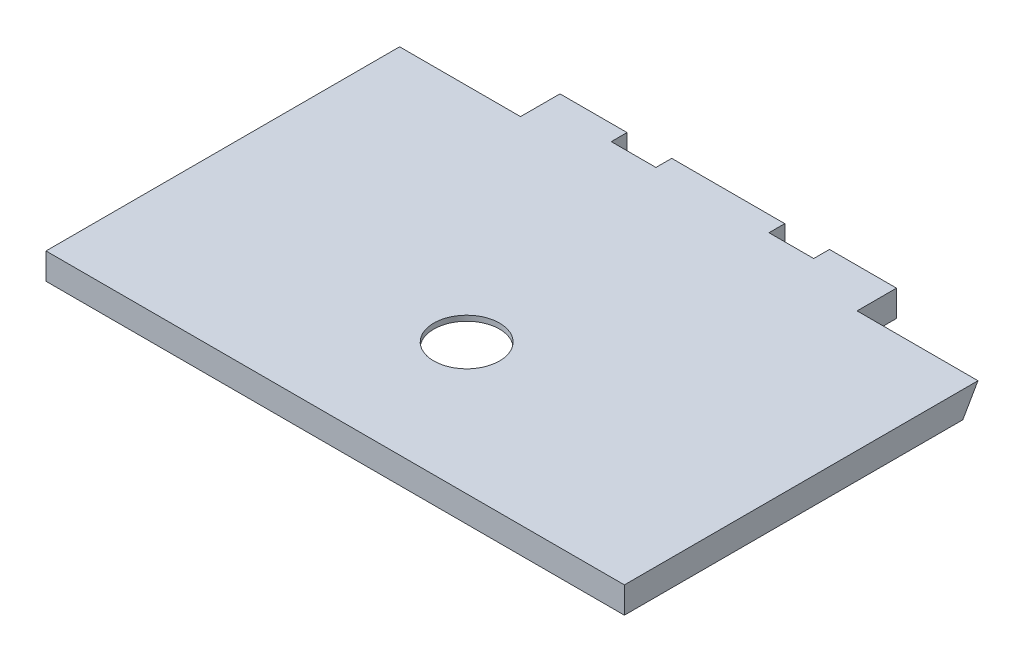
from build123d import *

# Parameters (mm, degrees)
SKETCH1_R                 = 12.5
BOSS_EXTRUDE1_DEPTH       = 10
SKETCH3_W                 = 17
SKETCH3_H                 = 6
CUT_EXTRUDE2_DEPTH        = 149.661528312
CUT_EXTRUDE3_DEPTH        = 46
CUT_EXTRUDE4_DEPTH        = 46
M4X0_7_TAPPED_HOLE1_D     = 3.3
M4X0_7_TAPPED_HOLE1_DEPTH = 8.5
M4X0_7_TAPPED_HOLE1_TIP   = 0.991420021
M4X0_7_TAPPED_HOLE2_D     = 3.3
M4X0_7_TAPPED_HOLE2_DEPTH = 8.5
M4X0_7_TAPPED_HOLE2_TIP   = 0.991420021
SKETCH10_R                = 27.5
CUT_EXTRUDE5_DEPTH        = 8


with BuildPart() as part:
    # Sketch1 → Boss-Extrude1 (new body)
    with BuildSketch(Plane(origin=(0, 0, 0), x_dir=(1, 0, 0), z_dir=(0, 1, 0))):
        Polygon((64, 99.5), (64, 84.5), (110, 84.5), (110, -50), (-110, -50), (-110, 84.5), (-64, 84.5), (-64, 99.5), align=None)
        with Locations(Location((0, 0, 0), (0, 0, 270))):
            Circle(SKETCH1_R, mode=Mode.SUBTRACT)
    extrude(amount=-BOSS_EXTRUDE1_DEPTH)

    # Sketch3 → Cut-Extrude2 (cut, through all)
    with BuildSketch(Plane(origin=(0, 0, 0), x_dir=(1, 0, 0), z_dir=(0, 1, 0))):
        with Locations((-30, 96.5)):
            Rectangle(SKETCH3_W, SKETCH3_H)
        with Locations((30, 96.5)):
            Rectangle(SKETCH3_W, SKETCH3_H)
    extrude(amount=-CUT_EXTRUDE2_DEPTH, mode=Mode.SUBTRACT)

    # Sketch4 → Cut-Extrude3 (cut)
    with BuildSketch(Plane(origin=(110, 0, 0), x_dir=(0, 0, -1), z_dir=(1, 0, 0))):
        Polygon((84.5, 0), (78.726497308, -10), (84.5, -10), align=None)
    extrude(amount=-CUT_EXTRUDE3_DEPTH, mode=Mode.SUBTRACT)

    # Sketch5 → Cut-Extrude4 (cut)
    with BuildSketch(Plane.ZY.offset(110)):
        Polygon((-84.5, 0), (-84.5, -10), (-78.726497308, -10), align=None)
    extrude(amount=-CUT_EXTRUDE4_DEPTH, mode=Mode.SUBTRACT)

    # M4x0.7 Tapped Hole1
    with Locations(Plane(origin=(0, -10, 0), x_dir=(-1, 0, 0), z_dir=(0, -1, 0))):
        with Locations((59, -24.003502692), (59, 55.996497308), (-59, -24.003502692), (-59, 55.996497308)):
            Hole(M4X0_7_TAPPED_HOLE1_D / 2, depth=M4X0_7_TAPPED_HOLE1_DEPTH)
            with Locations((0, 0, -(M4X0_7_TAPPED_HOLE1_DEPTH + M4X0_7_TAPPED_HOLE1_TIP / 2))):  # 118° drill point
                Cone(0, M4X0_7_TAPPED_HOLE1_D / 2, M4X0_7_TAPPED_HOLE1_TIP, mode=Mode.SUBTRACT)

    # M4x0.7 Tapped Hole2
    with Locations(Plane(origin=(0, -10, 0), x_dir=(-1, 0, 0), z_dir=(0, -1, 0))):
        with Locations((0, 94.996497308)):
            Hole(M4X0_7_TAPPED_HOLE2_D / 2, depth=M4X0_7_TAPPED_HOLE2_DEPTH)
            with Locations((0, 0, -(M4X0_7_TAPPED_HOLE2_DEPTH + M4X0_7_TAPPED_HOLE2_TIP / 2))):  # 118° drill point
                Cone(0, M4X0_7_TAPPED_HOLE2_D / 2, M4X0_7_TAPPED_HOLE2_TIP, mode=Mode.SUBTRACT)

    # Sketch10 → Cut-Extrude5 (cut)
    with BuildSketch(Plane.XZ.offset(10)):
        with Locations(Location((0, 0, 0), (0, 0, 270))):
            Circle(SKETCH10_R)
    extrude(amount=-CUT_EXTRUDE5_DEPTH, mode=Mode.SUBTRACT)


solid = part.part
